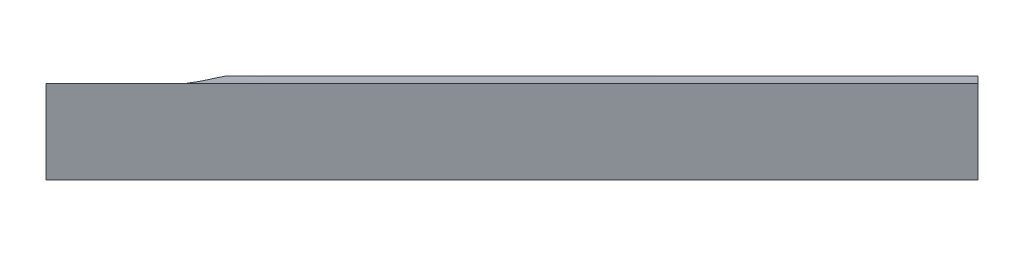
ISO-10303-21;
HEADER;
FILE_DESCRIPTION(('STEP AP214'),'2;1');
FILE_NAME('part.step','',(''),(''),'','','');
FILE_SCHEMA(('AUTOMOTIVE_DESIGN { 1 0 10303 214 1 1 1 1 }'));
ENDSEC;
DATA;
#1=APPLICATION_CONTEXT('core data for automotive mechanical design processes');
#2=APPLICATION_PROTOCOL_DEFINITION('international standard','automotive_design',2000,#1);
#3=PRODUCT_CONTEXT('',#1,'mechanical');
#4=PRODUCT('Part','Part','',(#3));
#5=PRODUCT_RELATED_PRODUCT_CATEGORY('part','',(#4));
#6=PRODUCT_DEFINITION_FORMATION('','',#4);
#7=PRODUCT_DEFINITION_CONTEXT('part definition',#1,'design');
#8=PRODUCT_DEFINITION('design','',#6,#7);
#9=PRODUCT_DEFINITION_SHAPE('','',#8);
#10=(LENGTH_UNIT() NAMED_UNIT(*) SI_UNIT(.MILLI.,.METRE.));
#11=(NAMED_UNIT(*) PLANE_ANGLE_UNIT() SI_UNIT($,.RADIAN.));
#12=(NAMED_UNIT(*) SI_UNIT($,.STERADIAN.) SOLID_ANGLE_UNIT());
#13=UNCERTAINTY_MEASURE_WITH_UNIT(LENGTH_MEASURE(1.E-05),#10,'distance_accuracy_value','');
#14=(GEOMETRIC_REPRESENTATION_CONTEXT(3) GLOBAL_UNCERTAINTY_ASSIGNED_CONTEXT((#13)) GLOBAL_UNIT_ASSIGNED_CONTEXT((#10,
#11,#12)) REPRESENTATION_CONTEXT('',''));
#15=CARTESIAN_POINT('',(0.,0.,0.));
#16=DIRECTION('',(0.,0.,1.));
#17=DIRECTION('',(1.,0.,0.));
#18=AXIS2_PLACEMENT_3D('',#15,#16,#17);
#19=CARTESIAN_POINT('',(136.966061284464,487.480000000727,0.));
#20=DIRECTION('',(0.,-1.,0.));
#21=DIRECTION('',(0.,0.,1.));
#22=AXIS2_PLACEMENT_3D('',#19,#20,#21);
#23=PLANE('',#22);
#24=DIRECTION('',(0.,0.,1.));
#25=VECTOR('',#24,1.);
#26=CARTESIAN_POINT('',(201.01,487.480000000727,-179.089689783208));
#27=LINE('',#26,#25);
#28=CARTESIAN_POINT('',(201.01,487.480000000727,-185.570430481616));
#29=VERTEX_POINT('',#28);
#30=CARTESIAN_POINT('',(201.01,487.480000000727,-179.089689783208));
#31=VERTEX_POINT('',#30);
#32=EDGE_CURVE('E90',#29,#31,#27,.T.);
#33=ORIENTED_EDGE('',*,*,#32,.F.);
#34=DIRECTION('',(0.70710678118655,0.,-0.707106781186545));
#35=VECTOR('',#34,1.);
#36=CARTESIAN_POINT('',(201.01,487.480000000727,-185.570430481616));
#37=LINE('',#36,#35);
#38=CARTESIAN_POINT('',(214.469784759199,487.480000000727,-199.030215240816));
#39=VERTEX_POINT('',#38);
#40=EDGE_CURVE('E61',#39,#29,#37,.F.);
#41=ORIENTED_EDGE('',*,*,#40,.F.);
#42=DIRECTION('',(0.707106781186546,0.,0.707106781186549));
#43=VECTOR('',#42,1.);
#44=CARTESIAN_POINT('',(230.000000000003,487.480000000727,-183.500000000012));
#45=LINE('',#44,#43);
#46=CARTESIAN_POINT('',(217.710155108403,487.480000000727,-195.789844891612));
#47=VERTEX_POINT('',#46);
#48=EDGE_CURVE('E130',#39,#47,#45,.T.);
#49=ORIENTED_EDGE('',*,*,#48,.T.);
#50=DIRECTION('',(-0.707106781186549,0.,0.707106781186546));
#51=VECTOR('',#50,1.);
#52=CARTESIAN_POINT('',(217.710155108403,487.480000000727,-195.789844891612));
#53=LINE('',#52,#51);
#54=EDGE_CURVE('E87',#47,#31,#53,.T.);
#55=ORIENTED_EDGE('',*,*,#54,.T.);
#56=EDGE_LOOP('',(#33,#41,#49,#55));
#57=FACE_BOUND('',#56,.T.);
#58=ADVANCED_FACE('F58',(#57),#23,.T.);
#59=CARTESIAN_POINT('',(210.328907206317,501.425317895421,-203.171092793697));
#60=DIRECTION('',(-0.707106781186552,0.,0.707106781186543));
#61=DIRECTION('',(0.707106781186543,0.,0.707106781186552));
#62=AXIS2_PLACEMENT_3D('',#59,#60,#61);
#63=PLANE('',#62);
#64=DIRECTION('',(0.,1.,0.));
#65=VECTOR('',#64,1.);
#66=CARTESIAN_POINT('',(217.710155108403,487.480000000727,-195.789844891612));
#67=LINE('',#66,#65);
#68=CARTESIAN_POINT('',(217.710155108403,490.480000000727,-195.789844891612));
#69=VERTEX_POINT('',#68);
#70=EDGE_CURVE('E129',#47,#69,#67,.T.);
#71=ORIENTED_EDGE('',*,*,#70,.F.);
#72=ORIENTED_EDGE('',*,*,#48,.F.);
#73=CARTESIAN_POINT('',(217.710155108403,490.480000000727,-195.789844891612));
#74=CARTESIAN_POINT('',(217.556536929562,490.27279216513,-195.943463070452));
#75=CARTESIAN_POINT('',(217.398547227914,490.072070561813,-196.101452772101));
#76=CARTESIAN_POINT('',(217.074407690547,489.684274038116,-196.425592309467));
#77=CARTESIAN_POINT('',(216.9082579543,489.497198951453,-196.591742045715));
#78=CARTESIAN_POINT('',(216.564803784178,489.133581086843,-196.935196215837));
#79=CARTESIAN_POINT('',(216.387338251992,488.957342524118,-197.112661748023));
#80=CARTESIAN_POINT('',(216.025162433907,488.620438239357,-197.474837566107));
#81=CARTESIAN_POINT('',(215.840452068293,488.459772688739,-197.659547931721));
#82=CARTESIAN_POINT('',(215.461618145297,488.152300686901,-198.038381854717));
#83=CARTESIAN_POINT('',(215.267394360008,488.005741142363,-198.232605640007));
#84=CARTESIAN_POINT('',(214.872920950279,487.729827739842,-198.627079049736));
#85=CARTESIAN_POINT('',(214.672671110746,487.600474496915,-198.827328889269));
#86=CARTESIAN_POINT('',(214.469784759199,487.480000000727,-199.030215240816));
#87=B_SPLINE_CURVE_WITH_KNOTS('',3,(#73,#74,#75,#76,#77,#78,#79,#80,#81,#82,#83,#84,#85,#86),
.UNSPECIFIED.,.F.,.F.,(4,2,2,2,2,2,4),(0.,0.900522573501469,1.80103417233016,2.72048278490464,
3.63994151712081,4.57333323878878,5.50675831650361),.UNSPECIFIED.);
#88=EDGE_CURVE('E101',#69,#39,#87,.T.);
#89=ORIENTED_EDGE('',*,*,#88,.F.);
#90=EDGE_LOOP('',(#71,#72,#89));
#91=FACE_BOUND('',#90,.T.);
#92=ADVANCED_FACE('F107',(#91),#63,.F.);
#93=CARTESIAN_POINT('',(217.710155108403,487.480000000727,-195.789844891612));
#94=DIRECTION('',(0.707106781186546,0.,0.707106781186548));
#95=DIRECTION('',(-0.707106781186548,0.,0.707106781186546));
#96=AXIS2_PLACEMENT_3D('',#93,#94,#95);
#97=PLANE('',#96);
#98=DIRECTION('',(-0.707106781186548,0.,0.707106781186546));
#99=VECTOR('',#98,1.);
#100=CARTESIAN_POINT('',(217.710155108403,490.480000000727,-195.789844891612));
#101=LINE('',#100,#99);
#102=CARTESIAN_POINT('',(201.01,490.480000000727,-179.089689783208));
#103=VERTEX_POINT('',#102);
#104=EDGE_CURVE('E67',#103,#69,#101,.F.);
#105=ORIENTED_EDGE('',*,*,#104,.F.);
#106=DIRECTION('',(0.,1.,0.));
#107=VECTOR('',#106,1.);
#108=CARTESIAN_POINT('',(201.01,487.480000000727,-179.089689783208));
#109=LINE('',#108,#107);
#110=EDGE_CURVE('E94',#31,#103,#109,.T.);
#111=ORIENTED_EDGE('',*,*,#110,.F.);
#112=ORIENTED_EDGE('',*,*,#54,.F.);
#113=ORIENTED_EDGE('',*,*,#70,.T.);
#114=EDGE_LOOP('',(#105,#111,#112,#113));
#115=FACE_BOUND('',#114,.T.);
#116=ADVANCED_FACE('F144',(#115),#97,.T.);
#117=CARTESIAN_POINT('',(201.01,512.007437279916,-192.989692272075));
#118=DIRECTION('',(-1.,0.,0.));
#119=DIRECTION('',(0.,0.,1.));
#120=AXIS2_PLACEMENT_3D('',#117,#118,#119);
#121=PLANE('',#120);
#122=ORIENTED_EDGE('',*,*,#110,.T.);
#123=CARTESIAN_POINT('',(201.01,487.480000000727,-185.570430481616));
#124=CARTESIAN_POINT('',(201.01,487.566796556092,-185.283488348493));
#125=CARTESIAN_POINT('',(201.01,487.658621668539,-184.998093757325));
#126=CARTESIAN_POINT('',(201.01,487.852219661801,-184.430724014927));
#127=CARTESIAN_POINT('',(201.01,487.953991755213,-184.148748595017));
#128=CARTESIAN_POINT('',(201.01,488.274061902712,-183.308433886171));
#129=CARTESIAN_POINT('',(201.01,488.507133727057,-182.75564036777));
#130=CARTESIAN_POINT('',(201.01,489.009324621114,-181.672414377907));
#131=CARTESIAN_POINT('',(201.01,489.278122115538,-181.141832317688));
#132=CARTESIAN_POINT('',(201.01,489.852108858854,-180.100307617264));
#133=CARTESIAN_POINT('',(201.01,490.157320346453,-179.589377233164));
#134=CARTESIAN_POINT('',(201.01,490.480000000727,-179.089689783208));
#135=B_SPLINE_CURVE_WITH_KNOTS('',3,(#123,#124,#125,#126,#127,#128,#129,#130,#131,#132,#133,
#134),.UNSPECIFIED.,.F.,.F.,(4,2,2,2,2,4),(0.,0.899250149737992,1.79842917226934,
3.59658150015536,5.37952441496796,7.1635618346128),.UNSPECIFIED.);
#136=EDGE_CURVE('E12',#29,#103,#135,.T.);
#137=ORIENTED_EDGE('',*,*,#136,.F.);
#138=ORIENTED_EDGE('',*,*,#32,.T.);
#139=EDGE_LOOP('',(#122,#137,#138));
#140=FACE_BOUND('',#139,.T.);
#141=ADVANCED_FACE('F96',(#140),#121,.T.);
#142=CARTESIAN_POINT('',(201.01,487.480000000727,-185.570430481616));
#143=CARTESIAN_POINT('',(201.462006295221,487.480000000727,-186.022436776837));
#144=CARTESIAN_POINT('',(202.022830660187,487.480000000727,-186.583261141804));
#145=CARTESIAN_POINT('',(202.926843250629,487.480000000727,-187.487273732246));
#146=CARTESIAN_POINT('',(203.596485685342,487.480000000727,-188.156916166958));
#147=CARTESIAN_POINT('',(204.358212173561,487.480000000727,-188.918642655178));
#148=CARTESIAN_POINT('',(204.810218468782,487.480000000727,-189.370648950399));
#149=CARTESIAN_POINT('',(205.18410137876,487.480000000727,-189.744531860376));
#150=CARTESIAN_POINT('',(205.544023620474,487.480000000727,-190.10445410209));
#151=CARTESIAN_POINT('',(205.962561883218,487.480000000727,-190.522992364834));
#152=CARTESIAN_POINT('',(206.275055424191,487.480000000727,-190.835485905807));
#153=CARTESIAN_POINT('',(206.819145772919,487.480000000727,-191.379576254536));
#154=CARTESIAN_POINT('',(207.304620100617,487.480000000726,-191.865050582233));
#155=CARTESIAN_POINT('',(208.175164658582,487.480000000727,-192.735595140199));
#156=CARTESIAN_POINT('',(208.66063898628,487.480000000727,-193.221069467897));
#157=CARTESIAN_POINT('',(209.204729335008,487.480000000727,-193.765159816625));
#158=CARTESIAN_POINT('',(209.517222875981,487.480000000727,-194.077653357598));
#159=CARTESIAN_POINT('',(209.935761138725,487.480000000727,-194.496191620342));
#160=CARTESIAN_POINT('',(210.295683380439,487.480000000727,-194.856113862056));
#161=CARTESIAN_POINT('',(210.669566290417,487.480000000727,-195.229996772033));
#162=CARTESIAN_POINT('',(211.121572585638,487.480000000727,-195.682003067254));
#163=CARTESIAN_POINT('',(211.883299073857,487.480000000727,-196.443729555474));
#164=CARTESIAN_POINT('',(212.552941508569,487.480000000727,-197.113371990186));
#165=CARTESIAN_POINT('',(213.456954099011,487.480000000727,-198.017384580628));
#166=CARTESIAN_POINT('',(214.017778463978,487.480000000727,-198.578208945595));
#167=CARTESIAN_POINT('',(214.469784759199,487.480000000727,-199.030215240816));
#168=CARTESIAN_POINT('',(201.01,488.173736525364,-183.276997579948));
#169=CARTESIAN_POINT('',(201.536413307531,488.180867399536,-183.764856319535));
#170=CARTESIAN_POINT('',(202.194724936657,488.189757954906,-184.375099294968));
#171=CARTESIAN_POINT('',(203.218486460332,488.19681154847,-185.360724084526));
#172=CARTESIAN_POINT('',(203.94065815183,488.196576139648,-186.084168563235));
#173=CARTESIAN_POINT('',(204.748946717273,488.194579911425,-186.903250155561));
#174=CARTESIAN_POINT('',(205.235140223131,488.194312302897,-187.390890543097));
#175=CARTESIAN_POINT('',(205.639039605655,488.194322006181,-187.794737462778));
#176=CARTESIAN_POINT('',(206.028982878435,488.194472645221,-188.183866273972));
#177=CARTESIAN_POINT('',(206.483302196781,488.194748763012,-188.636692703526));
#178=CARTESIAN_POINT('',(206.821626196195,488.194840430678,-188.974521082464));
#179=CARTESIAN_POINT('',(207.410147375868,488.194929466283,-189.56256087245));
#180=CARTESIAN_POINT('',(207.93353144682,488.194804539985,-190.086620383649));
#181=CARTESIAN_POINT('',(208.873148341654,488.194715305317,-191.026719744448));
#182=CARTESIAN_POINT('',(209.397753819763,488.194735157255,-191.551217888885));
#183=CARTESIAN_POINT('',(209.985711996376,488.194757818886,-192.139053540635));
#184=CARTESIAN_POINT('',(210.323395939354,488.194769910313,-192.476672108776));
#185=CARTESIAN_POINT('',(210.775573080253,488.194775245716,-192.9288204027));
#186=CARTESIAN_POINT('',(211.164362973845,488.194773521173,-193.317619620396));
#187=CARTESIAN_POINT('',(211.568217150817,488.19477015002,-193.721492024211));
#188=CARTESIAN_POINT('',(212.056437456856,488.194764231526,-194.209744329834));
#189=CARTESIAN_POINT('',(212.87926930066,488.194762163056,-195.032587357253));
#190=CARTESIAN_POINT('',(213.602680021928,488.194765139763,-195.75598198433));
#191=CARTESIAN_POINT('',(214.579254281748,488.194766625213,-196.73254821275));
#192=CARTESIAN_POINT('',(215.185076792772,488.194765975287,-197.338374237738));
#193=CARTESIAN_POINT('',(215.673349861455,488.194765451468,-197.82665013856));
#194=CARTESIAN_POINT('',(201.01,489.180283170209,-181.102608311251));
#195=CARTESIAN_POINT('',(201.575094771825,489.188972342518,-181.625782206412));
#196=CARTESIAN_POINT('',(202.283631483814,489.199805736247,-182.282053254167));
#197=CARTESIAN_POINT('',(203.386419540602,489.208400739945,-183.343374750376));
#198=CARTESIAN_POINT('',(204.162081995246,489.208113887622,-184.120421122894));
#199=CARTESIAN_POINT('',(205.029489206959,489.205681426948,-184.99956373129));
#200=CARTESIAN_POINT('',(205.551697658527,489.205355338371,-185.523345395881));
#201=CARTESIAN_POINT('',(205.985609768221,489.205367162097,-185.957200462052));
#202=CARTESIAN_POINT('',(206.404580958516,489.205550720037,-186.375286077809));
#203=CARTESIAN_POINT('',(206.892754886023,489.205887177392,-186.861836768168));
#204=CARTESIAN_POINT('',(207.256245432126,489.205998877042,-187.224788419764));
#205=CARTESIAN_POINT('',(207.888516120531,489.206107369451,-187.856535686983));
#206=CARTESIAN_POINT('',(208.450736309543,489.205955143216,-188.419490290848));
#207=CARTESIAN_POINT('',(209.460125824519,489.205846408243,-189.429404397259));
#208=CARTESIAN_POINT('',(210.023709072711,489.205870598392,-189.992870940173));
#209=CARTESIAN_POINT('',(210.655351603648,489.205898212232,-190.624380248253));
#210=CARTESIAN_POINT('',(211.018124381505,489.205912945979,-190.98708194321));
#211=CARTESIAN_POINT('',(211.503893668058,489.205919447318,-191.472819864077));
#212=CARTESIAN_POINT('',(211.921564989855,489.205917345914,-191.890501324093));
#213=CARTESIAN_POINT('',(212.355419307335,489.205913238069,-192.324375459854));
#214=CARTESIAN_POINT('',(212.879906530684,489.205906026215,-192.848897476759));
#215=CARTESIAN_POINT('',(213.763863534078,489.205903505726,-193.732866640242));
#216=CARTESIAN_POINT('',(214.541014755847,489.205907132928,-194.510000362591));
#217=CARTESIAN_POINT('',(215.590135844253,489.205908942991,-195.559112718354));
#218=CARTESIAN_POINT('',(216.240962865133,489.205908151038,-196.209943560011));
#219=CARTESIAN_POINT('',(216.765508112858,489.205907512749,-196.734491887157));
#220=CARTESIAN_POINT('',(201.01,490.480000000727,-179.089689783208));
#221=CARTESIAN_POINT('',(201.570824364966,490.480000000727,-179.650514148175));
#222=CARTESIAN_POINT('',(202.26666416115,490.480000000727,-180.346353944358));
#223=CARTESIAN_POINT('',(203.388312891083,490.480000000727,-181.468002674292));
#224=CARTESIAN_POINT('',(204.219168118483,490.480000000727,-182.298857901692));
#225=CARTESIAN_POINT('',(205.164276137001,490.480000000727,-183.24396592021));
#226=CARTESIAN_POINT('',(205.725100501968,490.480000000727,-183.804790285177));
#227=CARTESIAN_POINT('',(206.188993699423,490.480000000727,-184.268683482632));
#228=CARTESIAN_POINT('',(206.635565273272,490.480000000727,-184.715255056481));
#229=CARTESIAN_POINT('',(207.154864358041,490.480000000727,-185.234554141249));
#230=CARTESIAN_POINT('',(207.542589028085,490.480000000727,-185.622278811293));
#231=CARTESIAN_POINT('',(208.217666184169,490.480000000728,-186.297355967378));
#232=CARTESIAN_POINT('',(208.820015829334,490.480000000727,-186.899705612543));
#233=CARTESIAN_POINT('',(209.900139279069,490.480000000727,-187.979829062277));
#234=CARTESIAN_POINT('',(210.502488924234,490.480000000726,-188.582178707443));
#235=CARTESIAN_POINT('',(211.177566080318,490.480000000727,-189.257255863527));
#236=CARTESIAN_POINT('',(211.565290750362,490.480000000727,-189.644980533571));
#237=CARTESIAN_POINT('',(212.08458983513,490.480000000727,-190.164279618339));
#238=CARTESIAN_POINT('',(212.531161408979,490.480000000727,-190.610851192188));
#239=CARTESIAN_POINT('',(212.995054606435,490.480000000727,-191.074744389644));
#240=CARTESIAN_POINT('',(213.555878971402,490.480000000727,-191.63556875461));
#241=CARTESIAN_POINT('',(214.500986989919,490.480000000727,-192.580676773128));
#242=CARTESIAN_POINT('',(215.331842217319,490.480000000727,-193.411532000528));
#243=CARTESIAN_POINT('',(216.453490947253,490.480000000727,-194.533180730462));
#244=CARTESIAN_POINT('',(217.149330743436,490.480000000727,-195.229020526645));
#245=CARTESIAN_POINT('',(217.710155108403,490.480000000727,-195.789844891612));
#246=(BOUNDED_SURFACE() B_SPLINE_SURFACE(3,3,((#142,#143,#144,#145,#146,#147,#148,#149,#150,
#151,#152,#153,#154,#155,#156,#157,#158,#159,#160,#161,#162,#163,#164,#165,#166,#167),(#168,
#169,#170,#171,#172,#173,#174,#175,#176,#177,#178,#179,#180,#181,#182,#183,#184,#185,#186,#187,
#188,#189,#190,#191,#192,#193),(#194,#195,#196,#197,#198,#199,#200,#201,#202,#203,#204,#205,
#206,#207,#208,#209,#210,#211,#212,#213,#214,#215,#216,#217,#218,#219),(#220,#221,#222,#223,
#224,#225,#226,#227,#228,#229,#230,#231,#232,#233,#234,#235,#236,#237,#238,#239,#240,#241,#242,
#243,#244,#245)),.UNSPECIFIED.,.F.,.F.,.F.) B_SPLINE_SURFACE_WITH_KNOTS((4,4),(4,1,1,1,1,1,1,1,
1,1,1,1,1,1,1,1,1,1,1,1,1,1,1,4),(0.,1.),(0.,0.100745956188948,0.124999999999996,
0.2014919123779,0.249999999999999,0.294778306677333,0.302237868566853,0.333333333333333,
0.374999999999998,0.395524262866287,0.402983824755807,0.496270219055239,0.503729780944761,
0.597016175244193,0.604475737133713,0.624999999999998,0.666666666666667,0.697762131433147,
0.705221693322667,0.75,0.7985080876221,0.875000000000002,0.899254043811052,1.),
.UNSPECIFIED.) GEOMETRIC_REPRESENTATION_ITEM() RATIONAL_B_SPLINE_SURFACE(((1.,1.,1.,1.,1.,1.,1.,
1.,1.,1.,1.,1.,1.,1.,1.,1.,1.,1.,1.,1.,1.,1.,1.,1.,1.,1.),(0.993495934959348,0.993495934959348,
0.99083185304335,0.988226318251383,0.988313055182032,0.989049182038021,0.989147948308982,
0.989144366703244,0.989088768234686,0.988986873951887,0.988953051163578,0.988920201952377,
0.98896629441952,0.988999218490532,0.988991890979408,0.988983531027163,0.988979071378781,
0.988977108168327,0.988977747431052,0.988978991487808,0.98898117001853,0.988981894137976,
0.988980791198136,0.988980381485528,0.988980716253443,0.988980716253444),(0.993495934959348,
0.993495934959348,0.99083185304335,0.988226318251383,0.988313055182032,0.989049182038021,
0.989147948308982,0.989144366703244,0.989088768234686,0.988986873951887,0.988953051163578,
0.988920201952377,0.98896629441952,0.988999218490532,0.988991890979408,0.988983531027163,
0.988979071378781,0.988977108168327,0.988977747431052,0.988978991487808,0.98898117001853,
0.988981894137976,0.988980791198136,0.988980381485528,0.988980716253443,0.988980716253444),(1.,
1.,1.,1.,1.,1.,1.,1.,1.,1.,1.,1.,1.,1.,1.,1.,1.,1.,1.,1.,1.,1.,1.,1.,1.,1.))) REPRESENTATION_ITEM('') SURFACE());
#247=ORIENTED_EDGE('',*,*,#136,.T.);
#248=ORIENTED_EDGE('',*,*,#104,.T.);
#249=ORIENTED_EDGE('',*,*,#88,.T.);
#250=ORIENTED_EDGE('',*,*,#40,.T.);
#251=EDGE_LOOP('',(#247,#248,#249,#250));
#252=FACE_BOUND('',#251,.T.);
#253=ADVANCED_FACE('F100',(#252),#246,.T.);
#254=CLOSED_SHELL('',(#58,#92,#116,#141,#253));
#255=MANIFOLD_SOLID_BREP('B2',#254);
#256=ADVANCED_BREP_SHAPE_REPRESENTATION('',(#18,#255),#14);
#257=SHAPE_DEFINITION_REPRESENTATION(#9,#256);
ENDSEC;
END-ISO-10303-21;
